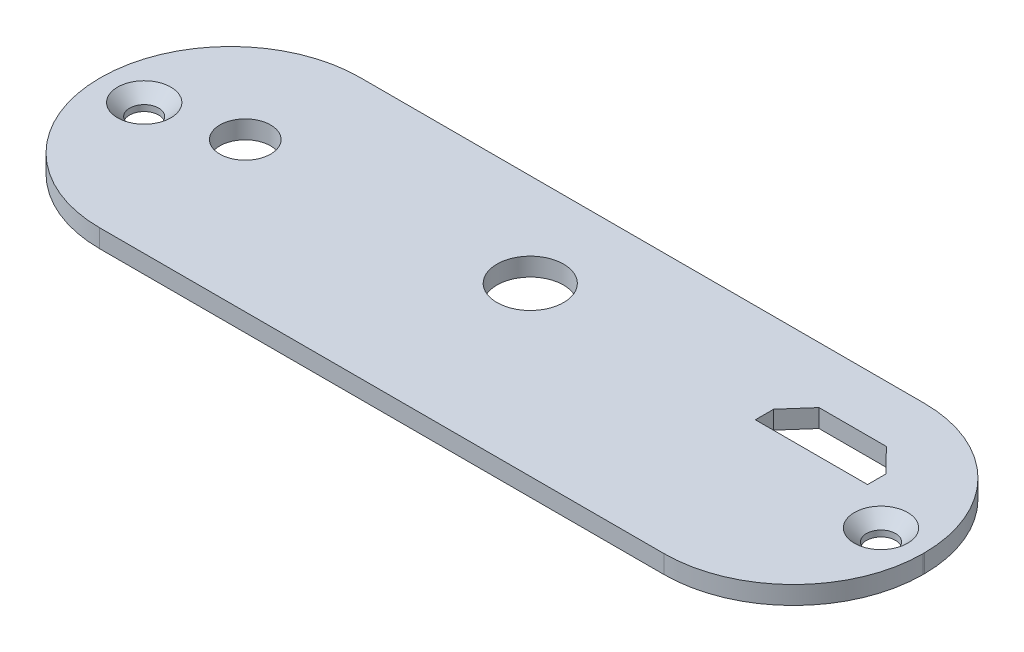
from build123d import *

# Parameters (mm, degrees)
BOSS_EXTRUDE1_DEPTH                            = 1.5
CSK_FOR_M2_FLAT_HEAD_MACHINE_SCREW1_AT_2_COUNT = 2
CSK_FOR_M2_FLAT_HEAD_MACHINE_SCREW1_AT_2_PITCH = 60.845537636
SKETCH5_R                                      = 2.751545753
SKETCH5_R_2                                    = 2.092589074
CUT_EXTRUDE1_DEPTH                             = 1.5


with BuildPart() as part:
    # Sketch1 → Boss-Extrude1 (new body)
    with BuildSketch(Plane(origin=(0, 0, 0), x_dir=(1, 0, 0), z_dir=(0, 1, 0))):
        with BuildLine():
            Line((10.7, 0), (57.3, 0))
            ThreePointArc((57.3, 0), (64.866042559, 3.133957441), (68, 10.7))
            Line((68, 10.7), (68, 10.8))
            ThreePointArc((68, 10.8), (64.866042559, 18.366042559), (57.3, 21.5))
            Line((57.3, 21.5), (10.7, 21.5))
            ThreePointArc((10.7, 21.5), (3.133957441, 18.366042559), (0, 10.8))
            Line((0, 10.8), (0, 10.7))
            ThreePointArc((0, 10.7), (3.133957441, 3.133957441), (10.7, 0))
        make_face()
    extrude(amount=BOSS_EXTRUDE1_DEPTH)

    # Sketch4 → CSK for M2 Flat Head Machine Screw1 (revolve, cut)
    with BuildSketch(Plane(origin=(3.578036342, 1.5, -10.8), x_dir=(0, 0, 1), z_dir=(1, 0, 0))):
        Polygon((0, 0), (0, 1.5), (1.2, 1.5), (1.2, 1), (2.2, 0), align=None)
    csk_for_m2_flat_head_machine_screw1 = revolve(axis=Axis((3.578036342, 7.85, -10.8), (0, -1, 0)), mode=Mode.SUBTRACT)

    # CSK for M2 Flat Head Machine Screw1 at 2: CSK for M2 Flat Head Machine Screw1 ×2
    with Locations(*[(i * CSK_FOR_M2_FLAT_HEAD_MACHINE_SCREW1_AT_2_PITCH, 0, 0) for i in range(1, CSK_FOR_M2_FLAT_HEAD_MACHINE_SCREW1_AT_2_COUNT)]):
        add(csk_for_m2_flat_head_machine_screw1, mode=Mode.SUBTRACT)

    # Sketch5 → Cut-Extrude1 (cut)
    with BuildSketch(Plane(origin=(0, 1.5, 0), x_dir=(1, 0, 0), z_dir=(0, 1, 0))):
        with Locations(Location((32.4514821, 13.806914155, 0), (0, 0, 270))):
            Circle(SKETCH5_R)
        with Locations(Location((10.4, 12.32139708, 0), (0, 0, 270))):
            Circle(SKETCH5_R_2)
        Polygon((51.504624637, 13.341005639), (51.504624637, 14.852732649), (53.260262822, 16.843943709), (58.823311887, 16.843943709), (60.76880255, 14.852732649), (60.76880255, 13.341005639), align=None)
    extrude(amount=-CUT_EXTRUDE1_DEPTH, mode=Mode.SUBTRACT)


solid = part.part
